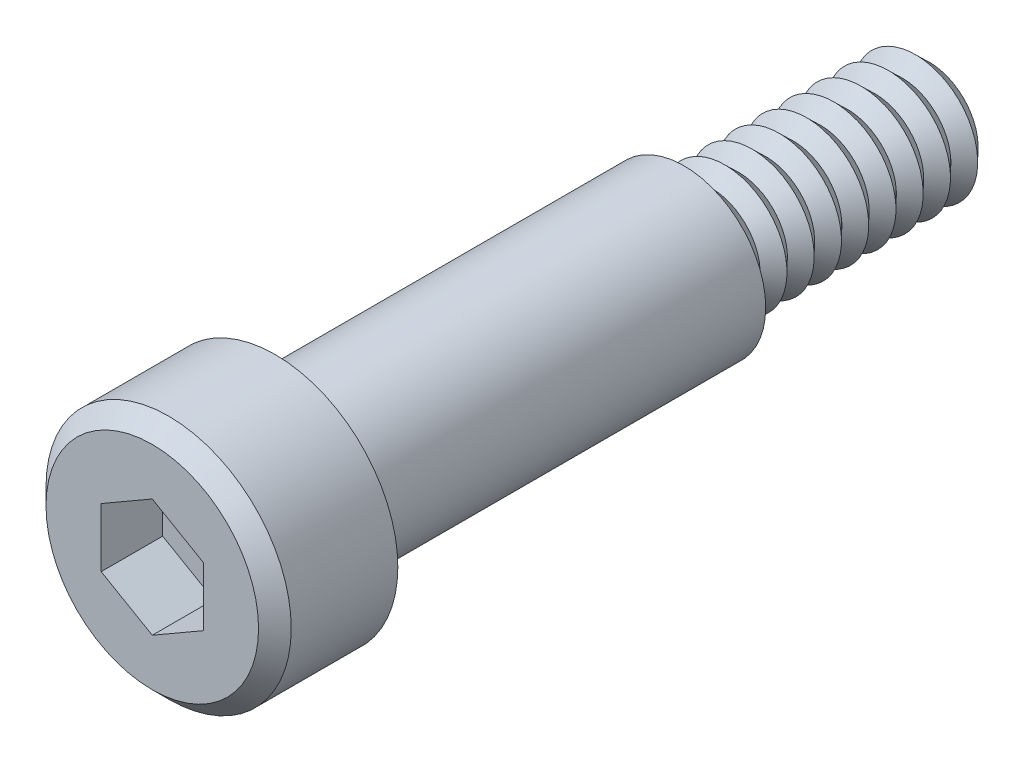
ISO-10303-21;
HEADER;
FILE_DESCRIPTION(('STEP AP214'),'2;1');
FILE_NAME('part.step','',(''),(''),'','','');
FILE_SCHEMA(('AUTOMOTIVE_DESIGN { 1 0 10303 214 1 1 1 1 }'));
ENDSEC;
DATA;
#1=APPLICATION_CONTEXT('core data for automotive mechanical design processes');
#2=APPLICATION_PROTOCOL_DEFINITION('international standard','automotive_design',2000,#1);
#3=PRODUCT_CONTEXT('',#1,'mechanical');
#4=PRODUCT('Part','Part','',(#3));
#5=PRODUCT_RELATED_PRODUCT_CATEGORY('part','',(#4));
#6=PRODUCT_DEFINITION_FORMATION('','',#4);
#7=PRODUCT_DEFINITION_CONTEXT('part definition',#1,'design');
#8=PRODUCT_DEFINITION('design','',#6,#7);
#9=PRODUCT_DEFINITION_SHAPE('','',#8);
#10=(LENGTH_UNIT() NAMED_UNIT(*) SI_UNIT(.MILLI.,.METRE.));
#11=(NAMED_UNIT(*) PLANE_ANGLE_UNIT() SI_UNIT($,.RADIAN.));
#12=(NAMED_UNIT(*) SI_UNIT($,.STERADIAN.) SOLID_ANGLE_UNIT());
#13=UNCERTAINTY_MEASURE_WITH_UNIT(LENGTH_MEASURE(1.E-05),#10,'distance_accuracy_value','');
#14=(GEOMETRIC_REPRESENTATION_CONTEXT(3) GLOBAL_UNCERTAINTY_ASSIGNED_CONTEXT((#13)) GLOBAL_UNIT_ASSIGNED_CONTEXT((#10,
#11,#12)) REPRESENTATION_CONTEXT('',''));
#15=CARTESIAN_POINT('',(0.,0.,0.));
#16=DIRECTION('',(0.,0.,1.));
#17=DIRECTION('',(1.,0.,0.));
#18=AXIS2_PLACEMENT_3D('',#15,#16,#17);
#19=CARTESIAN_POINT('',(0.,0.,25.4));
#20=DIRECTION('',(0.,0.,-1.));
#21=DIRECTION('',(-1.,0.,0.));
#22=AXIS2_PLACEMENT_3D('',#19,#20,#21);
#23=CYLINDRICAL_SURFACE('',#22,3.175);
#24=CARTESIAN_POINT('',(0.,0.,9.52500000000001));
#25=DIRECTION('',(0.,0.,1.));
#26=DIRECTION('',(1.,0.,0.));
#27=AXIS2_PLACEMENT_3D('',#24,#25,#26);
#28=CIRCLE('',#27,3.175);
#29=CARTESIAN_POINT('',(3.17500000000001,0.,9.52500000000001));
#30=VERTEX_POINT('',#29);
#31=EDGE_CURVE('E149',#30,#30,#28,.T.);
#32=ORIENTED_EDGE('',*,*,#31,.T.);
#33=EDGE_LOOP('',(#32));
#34=FACE_BOUND('',#33,.T.);
#35=CARTESIAN_POINT('',(0.,0.,24.6126));
#36=DIRECTION('',(0.,0.,1.));
#37=DIRECTION('',(1.,0.,0.));
#38=AXIS2_PLACEMENT_3D('',#35,#36,#37);
#39=CIRCLE('',#38,3.175);
#40=CARTESIAN_POINT('',(3.17500000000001,0.,24.6126));
#41=VERTEX_POINT('',#40);
#42=EDGE_CURVE('E236',#41,#41,#39,.T.);
#43=ORIENTED_EDGE('',*,*,#42,.F.);
#44=EDGE_LOOP('',(#43));
#45=FACE_BOUND('',#44,.T.);
#46=ADVANCED_FACE('F38',(#34,#45),#23,.T.);
#47=CARTESIAN_POINT('',(0.,0.,6.34999999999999));
#48=DIRECTION('',(0.,0.,1.));
#49=DIRECTION('',(1.,0.,0.));
#50=AXIS2_PLACEMENT_3D('',#47,#48,#49);
#51=CONICAL_SURFACE('',#50,1.89865,0.771200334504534);
#52=CARTESIAN_POINT('',(0.,0.,6.87916666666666));
#53=DIRECTION('',(0.,0.,-1.));
#54=DIRECTION('',(-1.,0.,0.));
#55=AXIS2_PLACEMENT_3D('',#52,#53,#54);
#56=CIRCLE('',#55,2.413);
#57=CARTESIAN_POINT('',(-2.41300000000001,0.,6.87916666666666));
#58=VERTEX_POINT('',#57);
#59=EDGE_CURVE('E256',#58,#58,#56,.T.);
#60=ORIENTED_EDGE('',*,*,#59,.T.);
#61=EDGE_LOOP('',(#60));
#62=FACE_BOUND('',#61,.T.);
#63=CARTESIAN_POINT('',(0.,0.,6.34999999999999));
#64=DIRECTION('',(0.,0.,-1.));
#65=DIRECTION('',(-1.,0.,0.));
#66=AXIS2_PLACEMENT_3D('',#63,#64,#65);
#67=CIRCLE('',#66,1.89865);
#68=CARTESIAN_POINT('',(-1.89865000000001,0.,6.34999999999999));
#69=VERTEX_POINT('',#68);
#70=EDGE_CURVE('E259',#69,#69,#67,.T.);
#71=ORIENTED_EDGE('',*,*,#70,.F.);
#72=EDGE_LOOP('',(#71));
#73=FACE_BOUND('',#72,.T.);
#74=ADVANCED_FACE('F171',(#62,#73),#51,.T.);
#75=CARTESIAN_POINT('',(0.,0.,6.34999999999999));
#76=DIRECTION('',(0.,0.,-1.));
#77=DIRECTION('',(-1.,0.,0.));
#78=AXIS2_PLACEMENT_3D('',#75,#76,#77);
#79=CONICAL_SURFACE('',#78,1.89865,0.771200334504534);
#80=CARTESIAN_POINT('',(0.,0.,5.82083333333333));
#81=DIRECTION('',(0.,0.,-1.));
#82=DIRECTION('',(-1.,0.,0.));
#83=AXIS2_PLACEMENT_3D('',#80,#81,#82);
#84=CIRCLE('',#83,2.413);
#85=CARTESIAN_POINT('',(-2.41300000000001,0.,5.82083333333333));
#86=VERTEX_POINT('',#85);
#87=EDGE_CURVE('E262',#86,#86,#84,.T.);
#88=ORIENTED_EDGE('',*,*,#87,.F.);
#89=EDGE_LOOP('',(#88));
#90=FACE_BOUND('',#89,.T.);
#91=ORIENTED_EDGE('',*,*,#70,.T.);
#92=EDGE_LOOP('',(#91));
#93=FACE_BOUND('',#92,.T.);
#94=ADVANCED_FACE('F177',(#90,#93),#79,.T.);
#95=CARTESIAN_POINT('',(0.,0.,0.));
#96=DIRECTION('',(0.,0.,1.));
#97=DIRECTION('',(1.,0.,0.));
#98=AXIS2_PLACEMENT_3D('',#95,#96,#97);
#99=PLANE('',#98);
#100=CARTESIAN_POINT('',(0.,0.,0.));
#101=DIRECTION('',(0.,0.,-1.));
#102=DIRECTION('',(-1.,0.,0.));
#103=AXIS2_PLACEMENT_3D('',#100,#101,#102);
#104=CIRCLE('',#103,1.89865);
#105=CARTESIAN_POINT('',(-1.89865000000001,0.,0.));
#106=VERTEX_POINT('',#105);
#107=EDGE_CURVE('E127',#106,#106,#104,.T.);
#108=ORIENTED_EDGE('',*,*,#107,.T.);
#109=EDGE_LOOP('',(#108));
#110=FACE_BOUND('',#109,.T.);
#111=ADVANCED_FACE('F183',(#110),#99,.F.);
#112=CARTESIAN_POINT('',(0.,0.,0.));
#113=DIRECTION('',(0.,0.,1.));
#114=DIRECTION('',(1.,0.,0.));
#115=AXIS2_PLACEMENT_3D('',#112,#113,#114);
#116=CONICAL_SURFACE('',#115,1.89865,0.771200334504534);
#117=CARTESIAN_POINT('',(0.,0.,0.529166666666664));
#118=DIRECTION('',(0.,0.,-1.));
#119=DIRECTION('',(-1.,0.,0.));
#120=AXIS2_PLACEMENT_3D('',#117,#118,#119);
#121=CIRCLE('',#120,2.413);
#122=CARTESIAN_POINT('',(-2.41300000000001,0.,0.529166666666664));
#123=VERTEX_POINT('',#122);
#124=EDGE_CURVE('E199',#123,#123,#121,.T.);
#125=ORIENTED_EDGE('',*,*,#124,.T.);
#126=EDGE_LOOP('',(#125));
#127=FACE_BOUND('',#126,.T.);
#128=ORIENTED_EDGE('',*,*,#107,.F.);
#129=EDGE_LOOP('',(#128));
#130=FACE_BOUND('',#129,.T.);
#131=ADVANCED_FACE('F185',(#127,#130),#116,.T.);
#132=CARTESIAN_POINT('',(0.,0.,1.05833333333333));
#133=DIRECTION('',(0.,0.,-1.));
#134=DIRECTION('',(-1.,0.,0.));
#135=AXIS2_PLACEMENT_3D('',#132,#133,#134);
#136=CONICAL_SURFACE('',#135,1.89865,0.771200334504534);
#137=ORIENTED_EDGE('',*,*,#124,.F.);
#138=EDGE_LOOP('',(#137));
#139=FACE_BOUND('',#138,.T.);
#140=CARTESIAN_POINT('',(0.,0.,1.05833333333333));
#141=DIRECTION('',(0.,0.,-1.));
#142=DIRECTION('',(-1.,0.,0.));
#143=AXIS2_PLACEMENT_3D('',#140,#141,#142);
#144=CIRCLE('',#143,1.89865);
#145=CARTESIAN_POINT('',(-1.89865000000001,0.,1.05833333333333));
#146=VERTEX_POINT('',#145);
#147=EDGE_CURVE('E202',#146,#146,#144,.T.);
#148=ORIENTED_EDGE('',*,*,#147,.T.);
#149=EDGE_LOOP('',(#148));
#150=FACE_BOUND('',#149,.T.);
#151=ADVANCED_FACE('F191',(#139,#150),#136,.T.);
#152=CARTESIAN_POINT('',(0.,0.,1.05833333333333));
#153=DIRECTION('',(0.,0.,1.));
#154=DIRECTION('',(1.,0.,0.));
#155=AXIS2_PLACEMENT_3D('',#152,#153,#154);
#156=CONICAL_SURFACE('',#155,1.89865,0.771200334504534);
#157=CARTESIAN_POINT('',(0.,0.,1.58750000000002));
#158=DIRECTION('',(0.,0.,-1.));
#159=DIRECTION('',(-1.,0.,0.));
#160=AXIS2_PLACEMENT_3D('',#157,#158,#159);
#161=CIRCLE('',#160,2.413);
#162=CARTESIAN_POINT('',(-2.41300000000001,0.,1.58750000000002));
#163=VERTEX_POINT('',#162);
#164=EDGE_CURVE('E286',#163,#163,#161,.T.);
#165=ORIENTED_EDGE('',*,*,#164,.T.);
#166=EDGE_LOOP('',(#165));
#167=FACE_BOUND('',#166,.T.);
#168=ORIENTED_EDGE('',*,*,#147,.F.);
#169=EDGE_LOOP('',(#168));
#170=FACE_BOUND('',#169,.T.);
#171=ADVANCED_FACE('F292',(#167,#170),#156,.T.);
#172=CARTESIAN_POINT('',(0.,0.,2.11666666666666));
#173=DIRECTION('',(0.,0.,-1.));
#174=DIRECTION('',(-1.,0.,0.));
#175=AXIS2_PLACEMENT_3D('',#172,#173,#174);
#176=CONICAL_SURFACE('',#175,1.89865,0.771200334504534);
#177=ORIENTED_EDGE('',*,*,#164,.F.);
#178=EDGE_LOOP('',(#177));
#179=FACE_BOUND('',#178,.T.);
#180=CARTESIAN_POINT('',(0.,0.,2.11666666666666));
#181=DIRECTION('',(0.,0.,-1.));
#182=DIRECTION('',(-1.,0.,0.));
#183=AXIS2_PLACEMENT_3D('',#180,#181,#182);
#184=CIRCLE('',#183,1.89865);
#185=CARTESIAN_POINT('',(-1.89865000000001,0.,2.11666666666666));
#186=VERTEX_POINT('',#185);
#187=EDGE_CURVE('E283',#186,#186,#184,.T.);
#188=ORIENTED_EDGE('',*,*,#187,.T.);
#189=EDGE_LOOP('',(#188));
#190=FACE_BOUND('',#189,.T.);
#191=ADVANCED_FACE('F294',(#179,#190),#176,.T.);
#192=CARTESIAN_POINT('',(0.,0.,2.11666666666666));
#193=DIRECTION('',(0.,0.,1.));
#194=DIRECTION('',(1.,0.,0.));
#195=AXIS2_PLACEMENT_3D('',#192,#193,#194);
#196=CONICAL_SURFACE('',#195,1.89865,0.771200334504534);
#197=CARTESIAN_POINT('',(0.,0.,2.64583333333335));
#198=DIRECTION('',(0.,0.,-1.));
#199=DIRECTION('',(-1.,0.,0.));
#200=AXIS2_PLACEMENT_3D('',#197,#198,#199);
#201=CIRCLE('',#200,2.413);
#202=CARTESIAN_POINT('',(-2.41300000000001,0.,2.64583333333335));
#203=VERTEX_POINT('',#202);
#204=EDGE_CURVE('E280',#203,#203,#201,.T.);
#205=ORIENTED_EDGE('',*,*,#204,.T.);
#206=EDGE_LOOP('',(#205));
#207=FACE_BOUND('',#206,.T.);
#208=ORIENTED_EDGE('',*,*,#187,.F.);
#209=EDGE_LOOP('',(#208));
#210=FACE_BOUND('',#209,.T.);
#211=ADVANCED_FACE('F301',(#207,#210),#196,.T.);
#212=CARTESIAN_POINT('',(0.,0.,3.17499999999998));
#213=DIRECTION('',(0.,0.,-1.));
#214=DIRECTION('',(-1.,0.,0.));
#215=AXIS2_PLACEMENT_3D('',#212,#213,#214);
#216=CONICAL_SURFACE('',#215,1.89865,0.771200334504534);
#217=ORIENTED_EDGE('',*,*,#204,.F.);
#218=EDGE_LOOP('',(#217));
#219=FACE_BOUND('',#218,.T.);
#220=CARTESIAN_POINT('',(0.,0.,3.17499999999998));
#221=DIRECTION('',(0.,0.,-1.));
#222=DIRECTION('',(-1.,0.,0.));
#223=AXIS2_PLACEMENT_3D('',#220,#221,#222);
#224=CIRCLE('',#223,1.89865);
#225=CARTESIAN_POINT('',(-1.89865000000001,0.,3.17499999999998));
#226=VERTEX_POINT('',#225);
#227=EDGE_CURVE('E277',#226,#226,#224,.T.);
#228=ORIENTED_EDGE('',*,*,#227,.T.);
#229=EDGE_LOOP('',(#228));
#230=FACE_BOUND('',#229,.T.);
#231=ADVANCED_FACE('F425',(#219,#230),#216,.T.);
#232=CARTESIAN_POINT('',(0.,0.,3.17499999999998));
#233=DIRECTION('',(0.,0.,1.));
#234=DIRECTION('',(1.,0.,0.));
#235=AXIS2_PLACEMENT_3D('',#232,#233,#234);
#236=CONICAL_SURFACE('',#235,1.89865,0.771200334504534);
#237=CARTESIAN_POINT('',(0.,0.,3.70416666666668));
#238=DIRECTION('',(0.,0.,-1.));
#239=DIRECTION('',(-1.,0.,0.));
#240=AXIS2_PLACEMENT_3D('',#237,#238,#239);
#241=CIRCLE('',#240,2.413);
#242=CARTESIAN_POINT('',(-2.41300000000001,0.,3.70416666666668));
#243=VERTEX_POINT('',#242);
#244=EDGE_CURVE('E274',#243,#243,#241,.T.);
#245=ORIENTED_EDGE('',*,*,#244,.T.);
#246=EDGE_LOOP('',(#245));
#247=FACE_BOUND('',#246,.T.);
#248=ORIENTED_EDGE('',*,*,#227,.F.);
#249=EDGE_LOOP('',(#248));
#250=FACE_BOUND('',#249,.T.);
#251=ADVANCED_FACE('F417',(#247,#250),#236,.T.);
#252=CARTESIAN_POINT('',(0.,0.,4.23333333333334));
#253=DIRECTION('',(0.,0.,-1.));
#254=DIRECTION('',(-1.,0.,0.));
#255=AXIS2_PLACEMENT_3D('',#252,#253,#254);
#256=CONICAL_SURFACE('',#255,1.89865,0.771200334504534);
#257=ORIENTED_EDGE('',*,*,#244,.F.);
#258=EDGE_LOOP('',(#257));
#259=FACE_BOUND('',#258,.T.);
#260=CARTESIAN_POINT('',(0.,0.,4.23333333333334));
#261=DIRECTION('',(0.,0.,-1.));
#262=DIRECTION('',(-1.,0.,0.));
#263=AXIS2_PLACEMENT_3D('',#260,#261,#262);
#264=CIRCLE('',#263,1.89865);
#265=CARTESIAN_POINT('',(-1.89865000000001,0.,4.23333333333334));
#266=VERTEX_POINT('',#265);
#267=EDGE_CURVE('E271',#266,#266,#264,.T.);
#268=ORIENTED_EDGE('',*,*,#267,.T.);
#269=EDGE_LOOP('',(#268));
#270=FACE_BOUND('',#269,.T.);
#271=ADVANCED_FACE('F409',(#259,#270),#256,.T.);
#272=CARTESIAN_POINT('',(0.,0.,4.23333333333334));
#273=DIRECTION('',(0.,0.,1.));
#274=DIRECTION('',(1.,0.,0.));
#275=AXIS2_PLACEMENT_3D('',#272,#273,#274);
#276=CONICAL_SURFACE('',#275,1.89865,0.771200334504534);
#277=CARTESIAN_POINT('',(0.,0.,4.7625));
#278=DIRECTION('',(0.,0.,-1.));
#279=DIRECTION('',(-1.,0.,0.));
#280=AXIS2_PLACEMENT_3D('',#277,#278,#279);
#281=CIRCLE('',#280,2.413);
#282=CARTESIAN_POINT('',(-2.41300000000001,0.,4.7625));
#283=VERTEX_POINT('',#282);
#284=EDGE_CURVE('E268',#283,#283,#281,.T.);
#285=ORIENTED_EDGE('',*,*,#284,.T.);
#286=EDGE_LOOP('',(#285));
#287=FACE_BOUND('',#286,.T.);
#288=ORIENTED_EDGE('',*,*,#267,.F.);
#289=EDGE_LOOP('',(#288));
#290=FACE_BOUND('',#289,.T.);
#291=ADVANCED_FACE('F401',(#287,#290),#276,.T.);
#292=CARTESIAN_POINT('',(0.,0.,5.29166666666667));
#293=DIRECTION('',(0.,0.,-1.));
#294=DIRECTION('',(-1.,0.,0.));
#295=AXIS2_PLACEMENT_3D('',#292,#293,#294);
#296=CONICAL_SURFACE('',#295,1.89865,0.771200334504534);
#297=ORIENTED_EDGE('',*,*,#284,.F.);
#298=EDGE_LOOP('',(#297));
#299=FACE_BOUND('',#298,.T.);
#300=CARTESIAN_POINT('',(0.,0.,5.29166666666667));
#301=DIRECTION('',(0.,0.,-1.));
#302=DIRECTION('',(-1.,0.,0.));
#303=AXIS2_PLACEMENT_3D('',#300,#301,#302);
#304=CIRCLE('',#303,1.89865);
#305=CARTESIAN_POINT('',(-1.89865000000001,0.,5.29166666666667));
#306=VERTEX_POINT('',#305);
#307=EDGE_CURVE('E265',#306,#306,#304,.T.);
#308=ORIENTED_EDGE('',*,*,#307,.T.);
#309=EDGE_LOOP('',(#308));
#310=FACE_BOUND('',#309,.T.);
#311=ADVANCED_FACE('F393',(#299,#310),#296,.T.);
#312=CARTESIAN_POINT('',(0.,0.,5.29166666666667));
#313=DIRECTION('',(0.,0.,1.));
#314=DIRECTION('',(1.,0.,0.));
#315=AXIS2_PLACEMENT_3D('',#312,#313,#314);
#316=CONICAL_SURFACE('',#315,1.89865,0.771200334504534);
#317=ORIENTED_EDGE('',*,*,#87,.T.);
#318=EDGE_LOOP('',(#317));
#319=FACE_BOUND('',#318,.T.);
#320=ORIENTED_EDGE('',*,*,#307,.F.);
#321=EDGE_LOOP('',(#320));
#322=FACE_BOUND('',#321,.T.);
#323=ADVANCED_FACE('F385',(#319,#322),#316,.T.);
#324=CARTESIAN_POINT('',(0.,0.,7.40833333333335));
#325=DIRECTION('',(0.,0.,-1.));
#326=DIRECTION('',(-1.,0.,0.));
#327=AXIS2_PLACEMENT_3D('',#324,#325,#326);
#328=CONICAL_SURFACE('',#327,1.89865,0.771200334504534);
#329=ORIENTED_EDGE('',*,*,#59,.F.);
#330=EDGE_LOOP('',(#329));
#331=FACE_BOUND('',#330,.T.);
#332=CARTESIAN_POINT('',(0.,0.,7.40833333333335));
#333=DIRECTION('',(0.,0.,-1.));
#334=DIRECTION('',(-1.,0.,0.));
#335=AXIS2_PLACEMENT_3D('',#332,#333,#334);
#336=CIRCLE('',#335,1.89865);
#337=CARTESIAN_POINT('',(-1.89865000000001,0.,7.40833333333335));
#338=VERTEX_POINT('',#337);
#339=EDGE_CURVE('E253',#338,#338,#336,.T.);
#340=ORIENTED_EDGE('',*,*,#339,.T.);
#341=EDGE_LOOP('',(#340));
#342=FACE_BOUND('',#341,.T.);
#343=ADVANCED_FACE('F377',(#331,#342),#328,.T.);
#344=CARTESIAN_POINT('',(0.,0.,7.40833333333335));
#345=DIRECTION('',(0.,0.,1.));
#346=DIRECTION('',(1.,0.,0.));
#347=AXIS2_PLACEMENT_3D('',#344,#345,#346);
#348=CONICAL_SURFACE('',#347,1.89865,0.771200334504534);
#349=CARTESIAN_POINT('',(0.,0.,7.93749999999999));
#350=DIRECTION('',(0.,0.,-1.));
#351=DIRECTION('',(-1.,0.,0.));
#352=AXIS2_PLACEMENT_3D('',#349,#350,#351);
#353=CIRCLE('',#352,2.413);
#354=CARTESIAN_POINT('',(-2.41300000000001,0.,7.93749999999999));
#355=VERTEX_POINT('',#354);
#356=EDGE_CURVE('E250',#355,#355,#353,.T.);
#357=ORIENTED_EDGE('',*,*,#356,.T.);
#358=EDGE_LOOP('',(#357));
#359=FACE_BOUND('',#358,.T.);
#360=ORIENTED_EDGE('',*,*,#339,.F.);
#361=EDGE_LOOP('',(#360));
#362=FACE_BOUND('',#361,.T.);
#363=ADVANCED_FACE('F369',(#359,#362),#348,.T.);
#364=CARTESIAN_POINT('',(0.,0.,8.46666666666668));
#365=DIRECTION('',(0.,0.,-1.));
#366=DIRECTION('',(-1.,0.,0.));
#367=AXIS2_PLACEMENT_3D('',#364,#365,#366);
#368=CONICAL_SURFACE('',#367,1.89865,0.771200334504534);
#369=ORIENTED_EDGE('',*,*,#356,.F.);
#370=EDGE_LOOP('',(#369));
#371=FACE_BOUND('',#370,.T.);
#372=CARTESIAN_POINT('',(0.,0.,8.46666666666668));
#373=DIRECTION('',(0.,0.,-1.));
#374=DIRECTION('',(-1.,0.,0.));
#375=AXIS2_PLACEMENT_3D('',#372,#373,#374);
#376=CIRCLE('',#375,1.89865);
#377=CARTESIAN_POINT('',(-1.89865000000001,0.,8.46666666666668));
#378=VERTEX_POINT('',#377);
#379=EDGE_CURVE('E247',#378,#378,#376,.T.);
#380=ORIENTED_EDGE('',*,*,#379,.T.);
#381=EDGE_LOOP('',(#380));
#382=FACE_BOUND('',#381,.T.);
#383=ADVANCED_FACE('F361',(#371,#382),#368,.T.);
#384=CARTESIAN_POINT('',(0.,0.,8.46666666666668));
#385=DIRECTION('',(0.,0.,1.));
#386=DIRECTION('',(1.,0.,0.));
#387=AXIS2_PLACEMENT_3D('',#384,#385,#386);
#388=CONICAL_SURFACE('',#387,1.89865,0.771200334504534);
#389=CARTESIAN_POINT('',(0.,0.,8.99583333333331));
#390=DIRECTION('',(0.,0.,-1.));
#391=DIRECTION('',(-1.,0.,0.));
#392=AXIS2_PLACEMENT_3D('',#389,#390,#391);
#393=CIRCLE('',#392,2.413);
#394=CARTESIAN_POINT('',(-2.41300000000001,0.,8.99583333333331));
#395=VERTEX_POINT('',#394);
#396=EDGE_CURVE('E244',#395,#395,#393,.T.);
#397=ORIENTED_EDGE('',*,*,#396,.T.);
#398=EDGE_LOOP('',(#397));
#399=FACE_BOUND('',#398,.T.);
#400=ORIENTED_EDGE('',*,*,#379,.F.);
#401=EDGE_LOOP('',(#400));
#402=FACE_BOUND('',#401,.T.);
#403=ADVANCED_FACE('F353',(#399,#402),#388,.T.);
#404=CARTESIAN_POINT('',(0.,0.,9.52500000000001));
#405=DIRECTION('',(0.,0.,-1.));
#406=DIRECTION('',(-1.,0.,0.));
#407=AXIS2_PLACEMENT_3D('',#404,#405,#406);
#408=CONICAL_SURFACE('',#407,1.89865,0.771200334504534);
#409=ORIENTED_EDGE('',*,*,#396,.F.);
#410=EDGE_LOOP('',(#409));
#411=FACE_BOUND('',#410,.T.);
#412=CARTESIAN_POINT('',(0.,0.,9.52500000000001));
#413=DIRECTION('',(0.,0.,-1.));
#414=DIRECTION('',(-1.,0.,0.));
#415=AXIS2_PLACEMENT_3D('',#412,#413,#414);
#416=CIRCLE('',#415,1.89865);
#417=CARTESIAN_POINT('',(-1.89865000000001,0.,9.52500000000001));
#418=VERTEX_POINT('',#417);
#419=EDGE_CURVE('E241',#418,#418,#416,.T.);
#420=ORIENTED_EDGE('',*,*,#419,.T.);
#421=EDGE_LOOP('',(#420));
#422=FACE_BOUND('',#421,.T.);
#423=ADVANCED_FACE('F346',(#411,#422),#408,.T.);
#424=CARTESIAN_POINT('',(0.,0.,9.52500000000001));
#425=DIRECTION('',(0.,0.,1.));
#426=DIRECTION('',(1.,0.,0.));
#427=AXIS2_PLACEMENT_3D('',#424,#425,#426);
#428=PLANE('',#427);
#429=ORIENTED_EDGE('',*,*,#31,.F.);
#430=EDGE_LOOP('',(#429));
#431=FACE_BOUND('',#430,.T.);
#432=ORIENTED_EDGE('',*,*,#419,.F.);
#433=EDGE_LOOP('',(#432));
#434=FACE_BOUND('',#433,.T.);
#435=ADVANCED_FACE('F182',(#431,#434),#428,.F.);
#436=CARTESIAN_POINT('',(0.,0.,24.6126));
#437=DIRECTION('',(0.,0.,1.));
#438=DIRECTION('',(1.,0.,0.));
#439=AXIS2_PLACEMENT_3D('',#436,#437,#438);
#440=PLANE('',#439);
#441=CARTESIAN_POINT('',(0.,0.,24.6126));
#442=DIRECTION('',(0.,0.,1.));
#443=DIRECTION('',(1.,0.,0.));
#444=AXIS2_PLACEMENT_3D('',#441,#442,#443);
#445=CIRCLE('',#444,3.048);
#446=CARTESIAN_POINT('',(3.04800000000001,0.,24.6126));
#447=VERTEX_POINT('',#446);
#448=EDGE_CURVE('E233',#447,#447,#445,.T.);
#449=ORIENTED_EDGE('',*,*,#448,.F.);
#450=EDGE_LOOP('',(#449));
#451=FACE_BOUND('',#450,.T.);
#452=ORIENTED_EDGE('',*,*,#42,.T.);
#453=EDGE_LOOP('',(#452));
#454=FACE_BOUND('',#453,.T.);
#455=ADVANCED_FACE('F331',(#451,#454),#440,.T.);
#456=CARTESIAN_POINT('',(0.,0.,24.6126));
#457=DIRECTION('',(0.,0.,1.));
#458=DIRECTION('',(1.,0.,0.));
#459=AXIS2_PLACEMENT_3D('',#456,#457,#458);
#460=CYLINDRICAL_SURFACE('',#459,3.048);
#461=ORIENTED_EDGE('',*,*,#448,.T.);
#462=EDGE_LOOP('',(#461));
#463=FACE_BOUND('',#462,.T.);
#464=CARTESIAN_POINT('',(0.,0.,25.4));
#465=DIRECTION('',(0.,0.,1.));
#466=DIRECTION('',(1.,0.,0.));
#467=AXIS2_PLACEMENT_3D('',#464,#465,#466);
#468=CIRCLE('',#467,3.048);
#469=CARTESIAN_POINT('',(3.04800000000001,0.,25.4));
#470=VERTEX_POINT('',#469);
#471=EDGE_CURVE('E231',#470,#470,#468,.T.);
#472=ORIENTED_EDGE('',*,*,#471,.F.);
#473=EDGE_LOOP('',(#472));
#474=FACE_BOUND('',#473,.T.);
#475=ADVANCED_FACE('F310',(#463,#474),#460,.T.);
#476=CARTESIAN_POINT('',(-1.98437500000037,1.14567944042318,27.7875999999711));
#477=DIRECTION('',(0.,0.,1.));
#478=DIRECTION('',(1.,0.,0.));
#479=AXIS2_PLACEMENT_3D('',#476,#477,#478);
#480=PLANE('',#479);
#481=DIRECTION('',(-0.866025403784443,-0.499999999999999,0.));
#482=VECTOR('',#481,1.);
#483=CARTESIAN_POINT('',(0.,2.29135888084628,27.7875999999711));
#484=LINE('',#483,#482);
#485=CARTESIAN_POINT('',(0.,2.29135888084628,27.7875999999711));
#486=VERTEX_POINT('',#485);
#487=CARTESIAN_POINT('',(-1.98437500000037,1.14567944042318,27.7875999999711));
#488=VERTEX_POINT('',#487);
#489=EDGE_CURVE('E139',#486,#488,#484,.T.);
#490=ORIENTED_EDGE('',*,*,#489,.T.);
#491=DIRECTION('',(0.,-1.,0.));
#492=VECTOR('',#491,1.);
#493=CARTESIAN_POINT('',(-1.98437500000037,1.14567944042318,27.7875999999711));
#494=LINE('',#493,#492);
#495=CARTESIAN_POINT('',(-1.98437500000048,-1.14567944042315,27.7875999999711));
#496=VERTEX_POINT('',#495);
#497=EDGE_CURVE('E120',#488,#496,#494,.T.);
#498=ORIENTED_EDGE('',*,*,#497,.T.);
#499=DIRECTION('',(-0.866025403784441,0.500000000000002,0.));
#500=VECTOR('',#499,1.);
#501=CARTESIAN_POINT('',(-4.44089209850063E-13,-2.29135888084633,27.7875999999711));
#502=LINE('',#501,#500);
#503=CARTESIAN_POINT('',(-4.44089209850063E-13,-2.29135888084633,27.7875999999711));
#504=VERTEX_POINT('',#503);
#505=EDGE_CURVE('E118',#504,#496,#502,.T.);
#506=ORIENTED_EDGE('',*,*,#505,.F.);
#507=DIRECTION('',(0.86602540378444,0.500000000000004,0.));
#508=VECTOR('',#507,1.);
#509=CARTESIAN_POINT('',(-4.44089209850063E-13,-2.29135888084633,27.7875999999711));
#510=LINE('',#509,#508);
#511=CARTESIAN_POINT('',(1.98437499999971,-1.14567944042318,27.7875999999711));
#512=VERTEX_POINT('',#511);
#513=EDGE_CURVE('E104',#504,#512,#510,.T.);
#514=ORIENTED_EDGE('',*,*,#513,.T.);
#515=DIRECTION('',(0.,-1.,0.));
#516=VECTOR('',#515,1.);
#517=CARTESIAN_POINT('',(1.98437499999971,1.14567944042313,27.7875999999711));
#518=LINE('',#517,#516);
#519=CARTESIAN_POINT('',(1.98437499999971,1.14567944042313,27.7875999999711));
#520=VERTEX_POINT('',#519);
#521=EDGE_CURVE('E94',#520,#512,#518,.T.);
#522=ORIENTED_EDGE('',*,*,#521,.F.);
#523=DIRECTION('',(0.866025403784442,-0.499999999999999,0.));
#524=VECTOR('',#523,1.);
#525=CARTESIAN_POINT('',(0.,2.29135888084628,27.7875999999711));
#526=LINE('',#525,#524);
#527=EDGE_CURVE('E103',#486,#520,#526,.T.);
#528=ORIENTED_EDGE('',*,*,#527,.F.);
#529=EDGE_LOOP('',(#490,#498,#506,#514,#522,#528));
#530=FACE_BOUND('',#529,.T.);
#531=ADVANCED_FACE('F116',(#530),#480,.T.);
#532=CARTESIAN_POINT('',(-1.98437500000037,1.14567944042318,27.7875999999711));
#533=DIRECTION('',(-1.,0.,0.));
#534=DIRECTION('',(0.,0.,1.));
#535=AXIS2_PLACEMENT_3D('',#532,#533,#534);
#536=PLANE('',#535);
#537=DIRECTION('',(0.,-1.,0.));
#538=VECTOR('',#537,1.);
#539=CARTESIAN_POINT('',(-1.98437500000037,1.14567944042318,30.1751999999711));
#540=LINE('',#539,#538);
#541=CARTESIAN_POINT('',(-1.98437500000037,1.14567944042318,30.1752));
#542=VERTEX_POINT('',#541);
#543=CARTESIAN_POINT('',(-1.98437500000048,-1.14567944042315,30.1751999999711));
#544=VERTEX_POINT('',#543);
#545=EDGE_CURVE('E126',#542,#544,#540,.T.);
#546=ORIENTED_EDGE('',*,*,#545,.T.);
#547=DIRECTION('',(0.,0.,1.));
#548=VECTOR('',#547,1.);
#549=CARTESIAN_POINT('',(-1.98437500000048,-1.14567944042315,27.7875999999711));
#550=LINE('',#549,#548);
#551=EDGE_CURVE('E144',#496,#544,#550,.T.);
#552=ORIENTED_EDGE('',*,*,#551,.F.);
#553=ORIENTED_EDGE('',*,*,#497,.F.);
#554=DIRECTION('',(0.,0.,1.));
#555=VECTOR('',#554,1.);
#556=CARTESIAN_POINT('',(-1.98437500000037,1.14567944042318,27.7875999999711));
#557=LINE('',#556,#555);
#558=EDGE_CURVE('E83',#488,#542,#557,.T.);
#559=ORIENTED_EDGE('',*,*,#558,.T.);
#560=EDGE_LOOP('',(#546,#552,#553,#559));
#561=FACE_BOUND('',#560,.T.);
#562=ADVANCED_FACE('F208',(#561),#536,.F.);
#563=CARTESIAN_POINT('',(-4.44089209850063E-13,-2.29135888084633,27.7875999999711));
#564=DIRECTION('',(0.500000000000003,0.86602540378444,0.));
#565=DIRECTION('',(-0.866025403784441,0.500000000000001,0.));
#566=AXIS2_PLACEMENT_3D('',#563,#564,#565);
#567=PLANE('',#566);
#568=DIRECTION('',(-0.866025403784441,0.500000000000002,0.));
#569=VECTOR('',#568,1.);
#570=CARTESIAN_POINT('',(-4.44089209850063E-13,-2.29135888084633,30.1751999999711));
#571=LINE('',#570,#569);
#572=CARTESIAN_POINT('',(-4.44089209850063E-13,-2.29135888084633,30.1751999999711));
#573=VERTEX_POINT('',#572);
#574=EDGE_CURVE('E130',#573,#544,#571,.T.);
#575=ORIENTED_EDGE('',*,*,#574,.F.);
#576=DIRECTION('',(0.,0.,1.));
#577=VECTOR('',#576,1.);
#578=CARTESIAN_POINT('',(-4.44089209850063E-13,-2.29135888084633,27.7875999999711));
#579=LINE('',#578,#577);
#580=EDGE_CURVE('E112',#504,#573,#579,.T.);
#581=ORIENTED_EDGE('',*,*,#580,.F.);
#582=ORIENTED_EDGE('',*,*,#505,.T.);
#583=ORIENTED_EDGE('',*,*,#551,.T.);
#584=EDGE_LOOP('',(#575,#581,#582,#583));
#585=FACE_BOUND('',#584,.T.);
#586=ADVANCED_FACE('F212',(#585),#567,.T.);
#587=CARTESIAN_POINT('',(-4.44089209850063E-13,-2.29135888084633,27.7875999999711));
#588=DIRECTION('',(0.500000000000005,-0.866025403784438,0.));
#589=DIRECTION('',(0.86602540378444,0.500000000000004,0.));
#590=AXIS2_PLACEMENT_3D('',#587,#588,#589);
#591=PLANE('',#590);
#592=DIRECTION('',(0.86602540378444,0.500000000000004,0.));
#593=VECTOR('',#592,1.);
#594=CARTESIAN_POINT('',(-4.44089209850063E-13,-2.29135888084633,30.1751999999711));
#595=LINE('',#594,#593);
#596=CARTESIAN_POINT('',(1.98437499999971,-1.14567944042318,30.1751999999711));
#597=VERTEX_POINT('',#596);
#598=EDGE_CURVE('E110',#573,#597,#595,.T.);
#599=ORIENTED_EDGE('',*,*,#598,.T.);
#600=DIRECTION('',(0.,0.,1.));
#601=VECTOR('',#600,1.);
#602=CARTESIAN_POINT('',(1.98437499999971,-1.14567944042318,27.7875999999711));
#603=LINE('',#602,#601);
#604=EDGE_CURVE('E98',#512,#597,#603,.T.);
#605=ORIENTED_EDGE('',*,*,#604,.F.);
#606=ORIENTED_EDGE('',*,*,#513,.F.);
#607=ORIENTED_EDGE('',*,*,#580,.T.);
#608=EDGE_LOOP('',(#599,#605,#606,#607));
#609=FACE_BOUND('',#608,.T.);
#610=ADVANCED_FACE('F108',(#609),#591,.F.);
#611=CARTESIAN_POINT('',(1.98437499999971,1.14567944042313,27.7875999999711));
#612=DIRECTION('',(-1.,0.,0.));
#613=DIRECTION('',(0.,0.,1.));
#614=AXIS2_PLACEMENT_3D('',#611,#612,#613);
#615=PLANE('',#614);
#616=DIRECTION('',(0.,-1.,0.));
#617=VECTOR('',#616,1.);
#618=CARTESIAN_POINT('',(1.98437499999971,1.14567944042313,30.1751999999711));
#619=LINE('',#618,#617);
#620=CARTESIAN_POINT('',(1.98437499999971,1.14567944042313,30.1751999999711));
#621=VERTEX_POINT('',#620);
#622=EDGE_CURVE('E134',#621,#597,#619,.T.);
#623=ORIENTED_EDGE('',*,*,#622,.F.);
#624=DIRECTION('',(0.,0.,1.));
#625=VECTOR('',#624,1.);
#626=CARTESIAN_POINT('',(1.98437499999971,1.14567944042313,27.7875999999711));
#627=LINE('',#626,#625);
#628=EDGE_CURVE('E100',#520,#621,#627,.T.);
#629=ORIENTED_EDGE('',*,*,#628,.F.);
#630=ORIENTED_EDGE('',*,*,#521,.T.);
#631=ORIENTED_EDGE('',*,*,#604,.T.);
#632=EDGE_LOOP('',(#623,#629,#630,#631));
#633=FACE_BOUND('',#632,.T.);
#634=ADVANCED_FACE('F97',(#633),#615,.T.);
#635=CARTESIAN_POINT('',(0.,2.29135888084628,27.7875999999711));
#636=DIRECTION('',(-0.500000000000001,-0.866025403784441,0.));
#637=DIRECTION('',(0.866025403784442,-0.499999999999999,0.));
#638=AXIS2_PLACEMENT_3D('',#635,#636,#637);
#639=PLANE('',#638);
#640=DIRECTION('',(0.866025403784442,-0.499999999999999,0.));
#641=VECTOR('',#640,1.);
#642=CARTESIAN_POINT('',(0.,2.29135888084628,30.1751999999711));
#643=LINE('',#642,#641);
#644=CARTESIAN_POINT('',(0.,2.29135888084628,30.1751999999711));
#645=VERTEX_POINT('',#644);
#646=EDGE_CURVE('E136',#645,#621,#643,.T.);
#647=ORIENTED_EDGE('',*,*,#646,.F.);
#648=DIRECTION('',(0.,0.,1.));
#649=VECTOR('',#648,1.);
#650=CARTESIAN_POINT('',(0.,2.29135888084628,27.7875999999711));
#651=LINE('',#650,#649);
#652=EDGE_CURVE('E61',#486,#645,#651,.T.);
#653=ORIENTED_EDGE('',*,*,#652,.F.);
#654=ORIENTED_EDGE('',*,*,#527,.T.);
#655=ORIENTED_EDGE('',*,*,#628,.T.);
#656=EDGE_LOOP('',(#647,#653,#654,#655));
#657=FACE_BOUND('',#656,.T.);
#658=ADVANCED_FACE('F213',(#657),#639,.T.);
#659=CARTESIAN_POINT('',(0.,2.29135888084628,27.7875999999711));
#660=DIRECTION('',(-0.5,0.86602540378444,0.));
#661=DIRECTION('',(-0.866025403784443,-0.499999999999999,0.));
#662=AXIS2_PLACEMENT_3D('',#659,#660,#661);
#663=PLANE('',#662);
#664=DIRECTION('',(-0.866025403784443,-0.499999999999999,0.));
#665=VECTOR('',#664,1.);
#666=CARTESIAN_POINT('',(0.,2.29135888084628,30.1751999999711));
#667=LINE('',#666,#665);
#668=EDGE_CURVE('E53',#645,#542,#667,.T.);
#669=ORIENTED_EDGE('',*,*,#668,.T.);
#670=ORIENTED_EDGE('',*,*,#558,.F.);
#671=ORIENTED_EDGE('',*,*,#489,.F.);
#672=ORIENTED_EDGE('',*,*,#652,.T.);
#673=EDGE_LOOP('',(#669,#670,#671,#672));
#674=FACE_BOUND('',#673,.T.);
#675=ADVANCED_FACE('F167',(#674),#663,.F.);
#676=CARTESIAN_POINT('',(0.,0.,30.1752));
#677=DIRECTION('',(0.,0.,1.));
#678=DIRECTION('',(1.,0.,0.));
#679=AXIS2_PLACEMENT_3D('',#676,#677,#678);
#680=PLANE('',#679);
#681=CARTESIAN_POINT('',(0.,0.,30.1752));
#682=DIRECTION('',(0.,0.,1.));
#683=DIRECTION('',(1.,0.,0.));
#684=AXIS2_PLACEMENT_3D('',#681,#682,#683);
#685=CIRCLE('',#684,4.12749999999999);
#686=CARTESIAN_POINT('',(4.1275,0.,30.1752));
#687=VERTEX_POINT('',#686);
#688=EDGE_CURVE('E46',#687,#687,#685,.T.);
#689=ORIENTED_EDGE('',*,*,#688,.T.);
#690=EDGE_LOOP('',(#689));
#691=FACE_BOUND('',#690,.T.);
#692=ORIENTED_EDGE('',*,*,#668,.F.);
#693=ORIENTED_EDGE('',*,*,#646,.T.);
#694=ORIENTED_EDGE('',*,*,#622,.T.);
#695=ORIENTED_EDGE('',*,*,#598,.F.);
#696=ORIENTED_EDGE('',*,*,#574,.T.);
#697=ORIENTED_EDGE('',*,*,#545,.F.);
#698=EDGE_LOOP('',(#692,#693,#694,#695,#696,#697));
#699=FACE_BOUND('',#698,.T.);
#700=ADVANCED_FACE('F154',(#691,#699),#680,.T.);
#701=CARTESIAN_POINT('',(0.,0.,30.1752));
#702=DIRECTION('',(0.,0.,-1.));
#703=DIRECTION('',(-1.,0.,0.));
#704=AXIS2_PLACEMENT_3D('',#701,#702,#703);
#705=CONICAL_SURFACE('',#704,4.12749999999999,0.785398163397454);
#706=CARTESIAN_POINT('',(0.,0.,29.5402));
#707=DIRECTION('',(0.,0.,1.));
#708=DIRECTION('',(1.,0.,0.));
#709=AXIS2_PLACEMENT_3D('',#706,#707,#708);
#710=CIRCLE('',#709,4.7625);
#711=CARTESIAN_POINT('',(4.76250000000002,0.,29.5402));
#712=VERTEX_POINT('',#711);
#713=EDGE_CURVE('E11',#712,#712,#710,.F.);
#714=ORIENTED_EDGE('',*,*,#713,.F.);
#715=EDGE_LOOP('',(#714));
#716=FACE_BOUND('',#715,.T.);
#717=ORIENTED_EDGE('',*,*,#688,.F.);
#718=EDGE_LOOP('',(#717));
#719=FACE_BOUND('',#718,.T.);
#720=ADVANCED_FACE('F40',(#716,#719),#705,.T.);
#721=CARTESIAN_POINT('',(0.,0.,30.1752));
#722=DIRECTION('',(0.,0.,-1.));
#723=DIRECTION('',(-1.,0.,0.));
#724=AXIS2_PLACEMENT_3D('',#721,#722,#723);
#725=CYLINDRICAL_SURFACE('',#724,4.7625);
#726=ORIENTED_EDGE('',*,*,#713,.T.);
#727=EDGE_LOOP('',(#726));
#728=FACE_BOUND('',#727,.T.);
#729=CARTESIAN_POINT('',(0.,0.,25.4));
#730=DIRECTION('',(0.,0.,1.));
#731=DIRECTION('',(1.,0.,0.));
#732=AXIS2_PLACEMENT_3D('',#729,#730,#731);
#733=CIRCLE('',#732,4.7625);
#734=CARTESIAN_POINT('',(4.76250000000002,0.,25.4));
#735=VERTEX_POINT('',#734);
#736=EDGE_CURVE('E141',#735,#735,#733,.T.);
#737=ORIENTED_EDGE('',*,*,#736,.T.);
#738=EDGE_LOOP('',(#737));
#739=FACE_BOUND('',#738,.T.);
#740=ADVANCED_FACE('F158',(#728,#739),#725,.T.);
#741=CARTESIAN_POINT('',(0.,0.,25.4));
#742=DIRECTION('',(0.,0.,1.));
#743=DIRECTION('',(1.,0.,0.));
#744=AXIS2_PLACEMENT_3D('',#741,#742,#743);
#745=PLANE('',#744);
#746=ORIENTED_EDGE('',*,*,#736,.F.);
#747=EDGE_LOOP('',(#746));
#748=FACE_BOUND('',#747,.T.);
#749=ORIENTED_EDGE('',*,*,#471,.T.);
#750=EDGE_LOOP('',(#749));
#751=FACE_BOUND('',#750,.T.);
#752=ADVANCED_FACE('F164',(#748,#751),#745,.F.);
#753=CLOSED_SHELL('',(#46,#74,#94,#111,#131,#151,#171,#191,#211,#231,#251,#271,#291,#311,#323,
#343,#363,#383,#403,#423,#435,#455,#475,#531,#562,#586,#610,#634,#658,#675,#700,#720,#740,#752));
#754=MANIFOLD_SOLID_BREP('B2',#753);
#755=ADVANCED_BREP_SHAPE_REPRESENTATION('',(#18,#754),#14);
#756=SHAPE_DEFINITION_REPRESENTATION(#9,#755);
ENDSEC;
END-ISO-10303-21;
